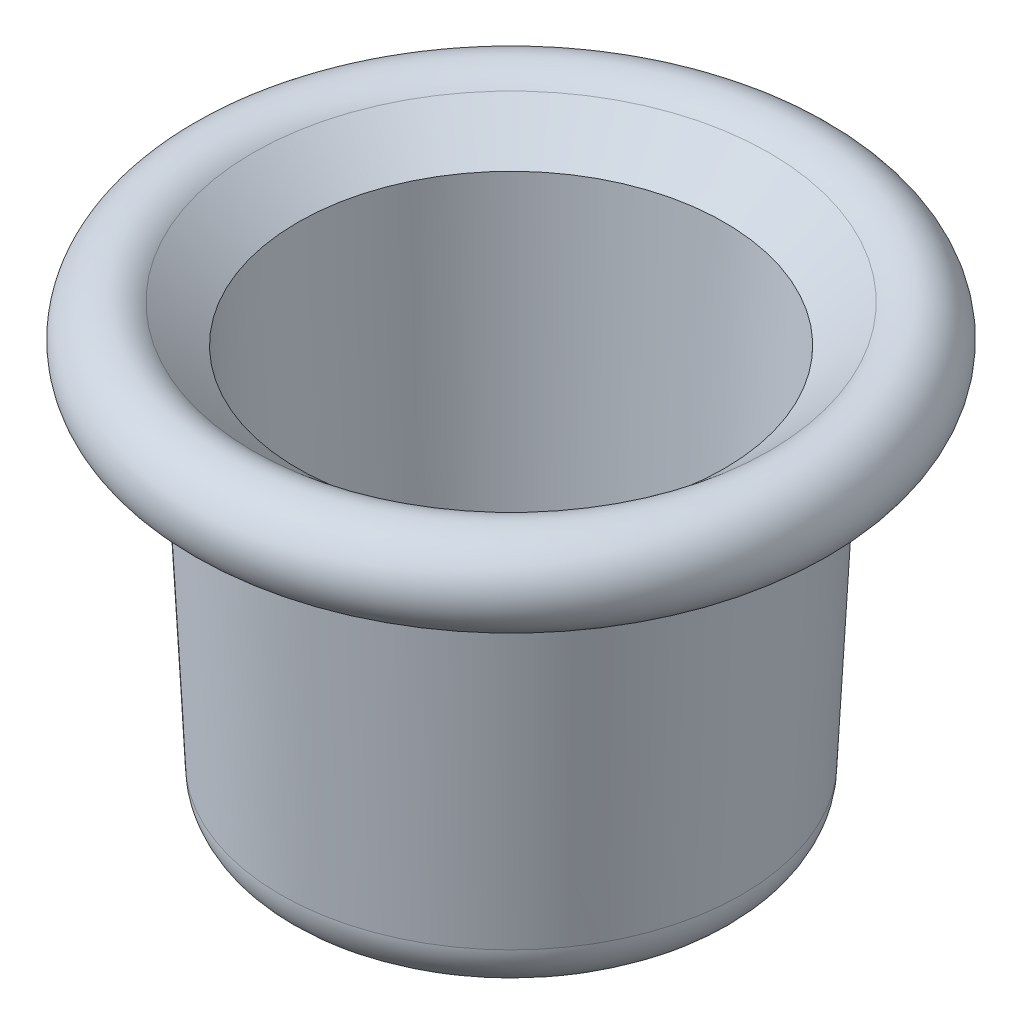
from build123d import *


with BuildPart() as part:
    # Esquisse1 → Base-R_volution (revolve)
    with BuildSketch(Plane.XY):
        with BuildLine():
            Line((3, 4.5), (3, 2.5))
            Line((3, 2.5), (4, 2.5))
            ThreePointArc((4, 2.5), (5.375, 1.125), (6.75, 2.5))
            Line((6.75, 2.5), (7.25, 12.638496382))
            ThreePointArc((7.25, 12.638496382), (9.589378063, 12.954738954), (7.560423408, 14.161404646))
            Line((7.560423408, 14.161404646), (6.245761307, 13.056735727))
            Line((6.245761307, 13.056735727), (5.823768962, 4.5))
            Line((5.823768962, 4.5), (4, 4.5))
            Line((4, 4.5), (3, 4.5))
        make_face()
    revolve(axis=Axis((0, -10, 0), (0, 1, 0)))


solid = part.part
